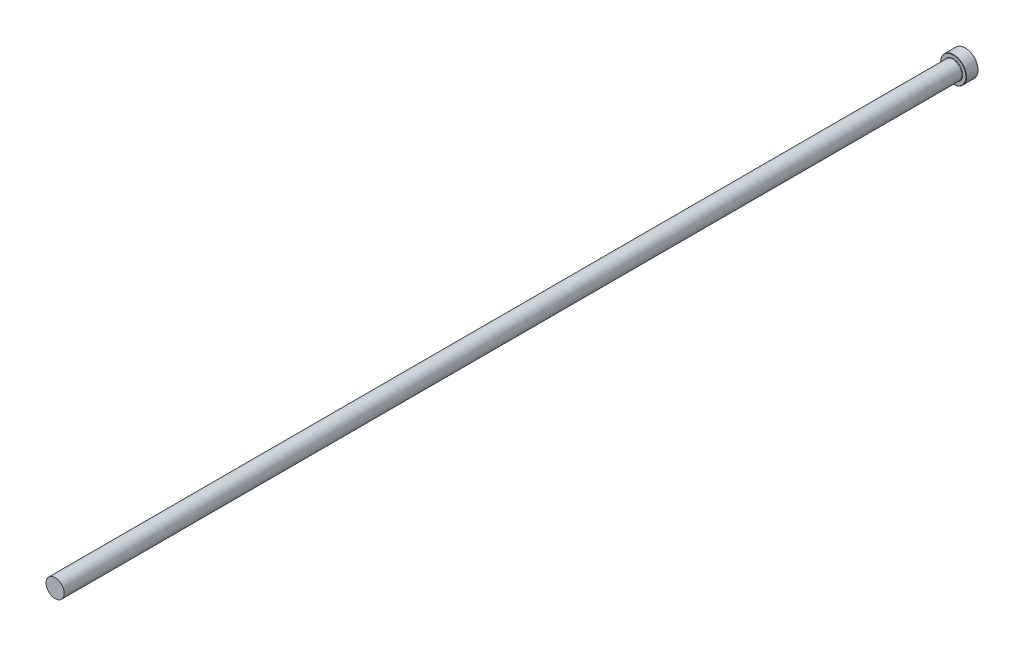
from build123d import *

# Parameters (mm, degrees)
CHAMFER1_SIZE = 0.2


with BuildPart() as part:
    # Sketch1 → Revolve1 (revolve)
    with BuildSketch(Plane(origin=(0, 0, 0), x_dir=(0, 0, -1), z_dir=(1, 0, 0)), mode=Mode.PRIVATE) as revolve1_sk:
        with BuildLine():
            Line((0, 0), (0, 8.5))
            Line((0, 8.5), (-8, 8.5))
            Line((-8, 8.5), (-8, 6.3))
            ThreePointArc((-8, 6.3), (-8.087867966, 6.087867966), (-8.3, 6))
            Line((-8.3, 6), (-600, 6))
            Line((-600, 6), (-600, 0))
            Line((-600, 0), (0, 0))
        make_face()
    revolve(revolve1_sk.sketch.rotate(Axis((0, 0, 109.05062828), (0, 0, -1)), 90), axis=Axis((0, 0, 109.05062828), (0, 0, -1)))

    # Chamfer1
    chamfer1_edges = [part.edges().sort_by_distance(p)[0] for p in [
        (-8.5, 0, 0),
        (-8.5, 0, 8),
    ]]
    chamfer(chamfer1_edges, length=CHAMFER1_SIZE)


solid = part.part
